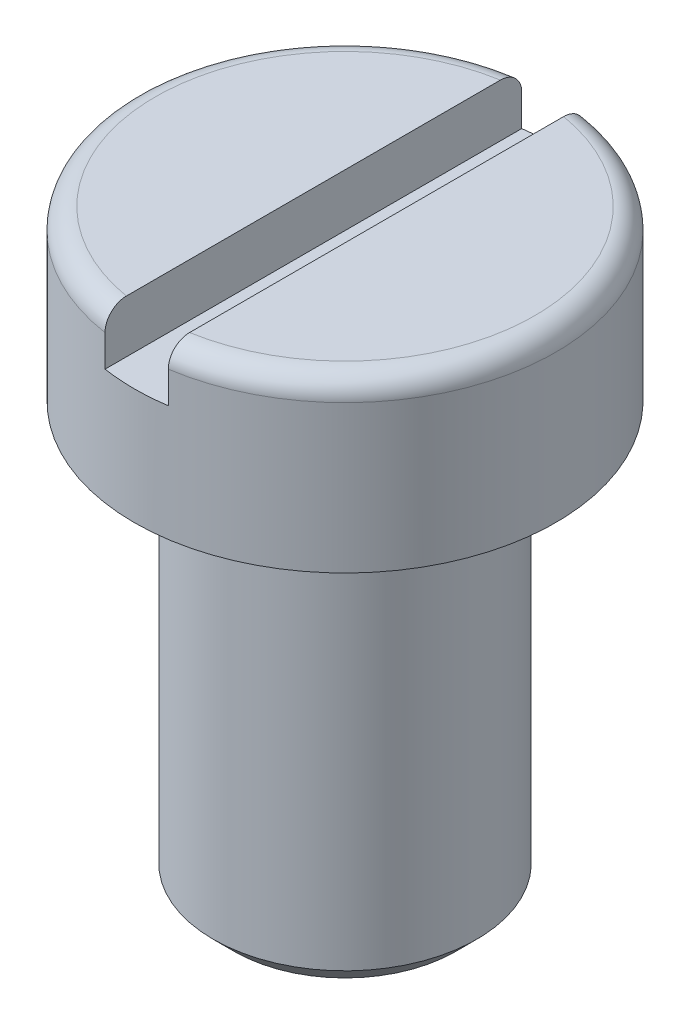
ISO-10303-21;
HEADER;
FILE_DESCRIPTION(('STEP AP214'),'2;1');
FILE_NAME('part.step','',(''),(''),'','','');
FILE_SCHEMA(('AUTOMOTIVE_DESIGN { 1 0 10303 214 1 1 1 1 }'));
ENDSEC;
DATA;
#1=APPLICATION_CONTEXT('core data for automotive mechanical design processes');
#2=APPLICATION_PROTOCOL_DEFINITION('international standard','automotive_design',2000,#1);
#3=PRODUCT_CONTEXT('',#1,'mechanical');
#4=PRODUCT('Part','Part','',(#3));
#5=PRODUCT_RELATED_PRODUCT_CATEGORY('part','',(#4));
#6=PRODUCT_DEFINITION_FORMATION('','',#4);
#7=PRODUCT_DEFINITION_CONTEXT('part definition',#1,'design');
#8=PRODUCT_DEFINITION('design','',#6,#7);
#9=PRODUCT_DEFINITION_SHAPE('','',#8);
#10=(LENGTH_UNIT() NAMED_UNIT(*) SI_UNIT(.MILLI.,.METRE.));
#11=(NAMED_UNIT(*) PLANE_ANGLE_UNIT() SI_UNIT($,.RADIAN.));
#12=(NAMED_UNIT(*) SI_UNIT($,.STERADIAN.) SOLID_ANGLE_UNIT());
#13=UNCERTAINTY_MEASURE_WITH_UNIT(LENGTH_MEASURE(1.E-05),#10,'distance_accuracy_value','');
#14=(GEOMETRIC_REPRESENTATION_CONTEXT(3) GLOBAL_UNCERTAINTY_ASSIGNED_CONTEXT((#13)) GLOBAL_UNIT_ASSIGNED_CONTEXT((#10,
#11,#12)) REPRESENTATION_CONTEXT('',''));
#15=CARTESIAN_POINT('',(0.,0.,0.));
#16=DIRECTION('',(0.,0.,1.));
#17=DIRECTION('',(1.,0.,0.));
#18=AXIS2_PLACEMENT_3D('',#15,#16,#17);
#19=CARTESIAN_POINT('',(2.,5.6,0.));
#20=DIRECTION('',(0.,-1.,0.));
#21=DIRECTION('',(0.,0.,-1.));
#22=AXIS2_PLACEMENT_3D('',#19,#20,#21);
#23=PLANE('',#22);
#24=CARTESIAN_POINT('',(0.,5.6,0.));
#25=DIRECTION('',(0.,-1.,0.));
#26=DIRECTION('',(0.,0.,-1.));
#27=AXIS2_PLACEMENT_3D('',#24,#25,#26);
#28=CIRCLE('',#27,1.8);
#29=CARTESIAN_POINT('',(0.3,5.60000000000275,1.77482393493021));
#30=VERTEX_POINT('',#29);
#31=CARTESIAN_POINT('',(0.3,5.6,-1.77482393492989));
#32=VERTEX_POINT('',#31);
#33=EDGE_CURVE('E129',#30,#32,#28,.F.);
#34=ORIENTED_EDGE('',*,*,#33,.T.);
#35=DIRECTION('',(0.,0.,1.));
#36=VECTOR('',#35,1.);
#37=CARTESIAN_POINT('',(0.3,5.6,0.));
#38=LINE('',#37,#36);
#39=EDGE_CURVE('E111',#32,#30,#38,.T.);
#40=ORIENTED_EDGE('',*,*,#39,.T.);
#41=EDGE_LOOP('',(#34,#40));
#42=FACE_BOUND('',#41,.T.);
#43=ADVANCED_FACE('F34',(#42),#23,.F.);
#44=CARTESIAN_POINT('',(0.,5.4,0.));
#45=DIRECTION('',(0.,-1.,0.));
#46=DIRECTION('',(0.,0.,-1.));
#47=AXIS2_PLACEMENT_3D('',#44,#45,#46);
#48=TOROIDAL_SURFACE('',#47,1.8,0.2);
#49=CARTESIAN_POINT('',(0.3,5.50581795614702,-1.94673315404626));
#50=CARTESIAN_POINT('',(0.3,5.49639199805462,-1.95267914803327));
#51=CARTESIAN_POINT('',(0.3,5.48646024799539,-1.95783763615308));
#52=CARTESIAN_POINT('',(0.3,5.46586441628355,-1.96641984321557));
#53=CARTESIAN_POINT('',(0.3,5.45519954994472,-1.96984166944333));
#54=CARTESIAN_POINT('',(0.3,5.43344743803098,-1.97484167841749));
#55=CARTESIAN_POINT('',(0.3,5.42236029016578,-1.97642028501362));
#56=CARTESIAN_POINT('',(0.3,5.40008126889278,-1.9776864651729));
#57=CARTESIAN_POINT('',(0.3,5.3888894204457,-1.97737447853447));
#58=CARTESIAN_POINT('',(0.3,5.36675222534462,-1.97487407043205));
#59=CARTESIAN_POINT('',(0.3,5.35580622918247,-1.97269139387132));
#60=CARTESIAN_POINT('',(0.3,5.33443467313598,-1.96652272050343));
#61=CARTESIAN_POINT('',(0.3,5.32400913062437,-1.96253666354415));
#62=CARTESIAN_POINT('',(0.3,5.30395059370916,-1.95287023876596));
#63=CARTESIAN_POINT('',(0.3,5.29431920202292,-1.94718654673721));
#64=CARTESIAN_POINT('',(0.3,5.2761374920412,-1.93429502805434));
#65=CARTESIAN_POINT('',(0.3,5.26758720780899,-1.92708715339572));
#66=CARTESIAN_POINT('',(0.3,5.25173476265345,-1.91129203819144));
#67=CARTESIAN_POINT('',(0.3,5.24444319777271,-1.90269416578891));
#68=CARTESIAN_POINT('',(0.3,5.23138729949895,-1.88440831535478));
#69=CARTESIAN_POINT('',(0.3,5.22562305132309,-1.87472027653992));
#70=CARTESIAN_POINT('',(0.3,5.21571351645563,-1.85440861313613));
#71=CARTESIAN_POINT('',(0.3,5.21158789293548,-1.84377539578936));
#72=CARTESIAN_POINT('',(0.3,5.20515788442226,-1.82197190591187));
#73=CARTESIAN_POINT('',(0.3,5.20285361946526,-1.81080159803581));
#74=CARTESIAN_POINT('',(0.3,5.20010731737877,-1.78810582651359));
#75=CARTESIAN_POINT('',(0.3,5.19968665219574,-1.77657777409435));
#76=CARTESIAN_POINT('',(0.3,5.20077363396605,-1.75361271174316));
#77=CARTESIAN_POINT('',(0.3,5.20228137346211,-1.74217570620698));
#78=CARTESIAN_POINT('',(0.3,5.20719894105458,-1.71964314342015));
#79=CARTESIAN_POINT('',(0.3,5.21062053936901,-1.70855015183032));
#80=CARTESIAN_POINT('',(0.3,5.21928237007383,-1.68709797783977));
#81=CARTESIAN_POINT('',(0.3,5.22452260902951,-1.67673879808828));
#82=CARTESIAN_POINT('',(0.3,5.23666393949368,-1.6570836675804));
#83=CARTESIAN_POINT('',(0.3,5.24356035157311,-1.647784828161));
#84=CARTESIAN_POINT('',(0.3,5.25883417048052,-1.63049484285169));
#85=CARTESIAN_POINT('',(0.3,5.26721148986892,-1.62250361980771));
#86=CARTESIAN_POINT('',(0.3,5.28510253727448,-1.60816402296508));
#87=CARTESIAN_POINT('',(0.3,5.29460111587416,-1.60179675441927));
#88=CARTESIAN_POINT('',(0.3,5.31454664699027,-1.5907787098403));
#89=CARTESIAN_POINT('',(0.3,5.32499350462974,-1.58612776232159));
#90=CARTESIAN_POINT('',(0.3,5.34635323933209,-1.57875433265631));
#91=CARTESIAN_POINT('',(0.3,5.35725554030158,-1.57600120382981));
#92=CARTESIAN_POINT('',(0.3,5.37936932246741,-1.57238902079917));
#93=CARTESIAN_POINT('',(0.3,5.3905807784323,-1.57152981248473));
#94=CARTESIAN_POINT('',(0.3,5.41285260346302,-1.57173189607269));
#95=CARTESIAN_POINT('',(0.3,5.42391318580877,-1.57277050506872));
#96=CARTESIAN_POINT('',(0.3,5.4457023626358,-1.57669071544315));
#97=CARTESIAN_POINT('',(0.3,5.45643096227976,-1.57957228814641));
#98=CARTESIAN_POINT('',(0.3,5.47725322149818,-1.58708729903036));
#99=CARTESIAN_POINT('',(0.3,5.48734698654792,-1.59172044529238));
#100=CARTESIAN_POINT('',(0.3,5.50662554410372,-1.60259704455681));
#101=CARTESIAN_POINT('',(0.3,5.51581029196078,-1.60884057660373));
#102=CARTESIAN_POINT('',(0.3,5.53312543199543,-1.62283357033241));
#103=CARTESIAN_POINT('',(0.3,5.54124253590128,-1.63059946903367));
#104=CARTESIAN_POINT('',(0.3,5.55608358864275,-1.64736430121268));
#105=CARTESIAN_POINT('',(0.3,5.56280741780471,-1.65636334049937));
#106=CARTESIAN_POINT('',(0.3,5.57478654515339,-1.67549696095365));
#107=CARTESIAN_POINT('',(0.3,5.58001603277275,-1.68564770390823));
#108=CARTESIAN_POINT('',(0.3,5.58872147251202,-1.70667523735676));
#109=CARTESIAN_POINT('',(0.3,5.59219728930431,-1.71755208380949));
#110=CARTESIAN_POINT('',(0.3,5.59733740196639,-1.73987258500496));
#111=CARTESIAN_POINT('',(0.3,5.59897798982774,-1.75132170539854));
#112=CARTESIAN_POINT('',(0.3,5.60032192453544,-1.77433293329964));
#113=CARTESIAN_POINT('',(0.3,5.60002527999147,-1.78589504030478));
#114=CARTESIAN_POINT('',(0.3,5.59749470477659,-1.80884900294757));
#115=CARTESIAN_POINT('',(0.3,5.59525361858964,-1.82024007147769));
#116=CARTESIAN_POINT('',(0.3,5.58887960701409,-1.84248372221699));
#117=CARTESIAN_POINT('',(0.3,5.58474624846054,-1.85333618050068));
#118=CARTESIAN_POINT('',(0.3,5.574723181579,-1.8741296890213));
#119=CARTESIAN_POINT('',(0.3,5.56884232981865,-1.88407501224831));
#120=CARTESIAN_POINT('',(0.3,5.55548020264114,-1.90281298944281));
#121=CARTESIAN_POINT('',(0.3,5.54800095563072,-1.91160708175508));
#122=CARTESIAN_POINT('',(0.3,5.53467358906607,-1.92479930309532));
#123=CARTESIAN_POINT('',(0.3,5.52923992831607,-1.92962322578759));
#124=CARTESIAN_POINT('',(0.3,5.51788167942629,-1.93865383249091));
#125=CARTESIAN_POINT('',(0.3,5.51195709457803,-1.94286052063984));
#126=CARTESIAN_POINT('',(0.3,5.50581795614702,-1.94673315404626));
#127=B_SPLINE_CURVE_WITH_KNOTS('',3,(#49,#50,#51,#52,#53,#54,#55,#56,#57,#58,#59,#60,#61,#62,
#63,#64,#65,#66,#67,#68,#69,#70,#71,#72,#73,#74,#75,#76,#77,#78,#79,#80,#81,#82,#83,#84,#85,#86,
#87,#88,#89,#90,#91,#92,#93,#94,#95,#96,#97,#98,#99,#100,#101,#102,#103,#104,#105,#106,#107,
#108,#109,#110,#111,#112,#113,#114,#115,#116,#117,#118,#119,#120,#121,#122,#123,#124,#125,#126),
.UNSPECIFIED.,.T.,.F.,(4,2,2,2,2,2,2,2,2,2,2,2,2,2,2,2,2,2,2,2,2,2,2,2,2,2,2,2,2,2,2,2,2,2,2,2,
2,2,4),(0.,0.033407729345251,0.0668517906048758,0.100288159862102,0.133716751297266,
0.16704304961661,0.200370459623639,0.233763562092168,0.267157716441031,0.300820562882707,
0.334485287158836,0.368542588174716,0.402602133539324,0.437047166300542,0.471493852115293,
0.506154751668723,0.540815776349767,0.575379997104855,0.609942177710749,0.644081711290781,
0.678217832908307,0.711788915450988,0.745357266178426,0.778527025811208,0.811696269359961,
0.844859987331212,0.87802533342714,0.911570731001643,0.945119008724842,0.979215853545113,
1.01331532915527,1.04785039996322,1.08238531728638,1.11704786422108,1.15171834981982,
1.18621603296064,1.22067019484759,1.2424288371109,1.26418733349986),.UNSPECIFIED.);
#128=CARTESIAN_POINT('',(0.3,5.39999999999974,-1.97737199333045));
#129=VERTEX_POINT('',#128);
#130=EDGE_CURVE('E57',#32,#129,#127,.T.);
#131=ORIENTED_EDGE('',*,*,#130,.F.);
#132=ORIENTED_EDGE('',*,*,#33,.F.);
#133=CARTESIAN_POINT('',(0.3,5.48593501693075,1.59137267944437));
#134=CARTESIAN_POINT('',(0.3,5.47596944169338,1.5865476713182));
#135=CARTESIAN_POINT('',(0.3,5.46559278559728,1.58255469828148));
#136=CARTESIAN_POINT('',(0.3,5.44430883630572,1.57636279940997));
#137=CARTESIAN_POINT('',(0.3,5.43340100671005,1.57416572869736));
#138=CARTESIAN_POINT('',(0.3,5.41137201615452,1.57164002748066));
#139=CARTESIAN_POINT('',(0.3,5.40025089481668,1.57131105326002));
#140=CARTESIAN_POINT('',(0.3,5.37811500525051,1.57253171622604));
#141=CARTESIAN_POINT('',(0.3,5.36710021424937,1.57408094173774));
#142=CARTESIAN_POINT('',(0.3,5.34551931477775,1.57900052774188));
#143=CARTESIAN_POINT('',(0.3,5.33495199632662,1.58236558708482));
#144=CARTESIAN_POINT('',(0.3,5.31452562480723,1.59080886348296));
#145=CARTESIAN_POINT('',(0.3,5.30466661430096,1.59588718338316));
#146=CARTESIAN_POINT('',(0.3,5.28585195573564,1.60764896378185));
#147=CARTESIAN_POINT('',(0.3,5.27690387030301,1.61434451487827));
#148=CARTESIAN_POINT('',(0.3,5.26023687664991,1.62912153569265));
#149=CARTESIAN_POINT('',(0.3,5.25251806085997,1.63720310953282));
#150=CARTESIAN_POINT('',(0.3,5.23840008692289,1.65465695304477));
#151=CARTESIAN_POINT('',(0.3,5.23202337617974,1.66404737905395));
#152=CARTESIAN_POINT('',(0.3,5.22090963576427,1.68375292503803));
#153=CARTESIAN_POINT('',(0.3,5.21617274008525,1.69406812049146));
#154=CARTESIAN_POINT('',(0.3,5.20840282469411,1.71549636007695));
#155=CARTESIAN_POINT('',(0.3,5.20539629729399,1.7266190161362));
#156=CARTESIAN_POINT('',(0.3,5.20127780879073,1.74920994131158));
#157=CARTESIAN_POINT('',(0.3,5.2001659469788,1.7606782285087));
#158=CARTESIAN_POINT('',(0.3,5.19986747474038,1.78372481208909));
#159=CARTESIAN_POINT('',(0.3,5.20069509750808,1.79530329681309));
#160=CARTESIAN_POINT('',(0.3,5.20428688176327,1.81815624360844));
#161=CARTESIAN_POINT('',(0.3,5.207051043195,1.82943070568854));
#162=CARTESIAN_POINT('',(0.3,5.2144365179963,1.85132497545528));
#163=CARTESIAN_POINT('',(0.3,5.21905345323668,1.8619462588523));
#164=CARTESIAN_POINT('',(0.3,5.23002177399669,1.88225233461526));
#165=CARTESIAN_POINT('',(0.3,5.23637308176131,1.89193716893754));
#166=CARTESIAN_POINT('',(0.3,5.2505664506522,1.90999388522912));
#167=CARTESIAN_POINT('',(0.3,5.25839355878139,1.91837751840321));
#168=CARTESIAN_POINT('',(0.3,5.27535960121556,1.9336917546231));
#169=CARTESIAN_POINT('',(0.3,5.28449844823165,1.94062245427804));
#170=CARTESIAN_POINT('',(0.3,5.30370882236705,1.95274489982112));
#171=CARTESIAN_POINT('',(0.3,5.31376763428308,1.95795679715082));
#172=CARTESIAN_POINT('',(0.3,5.33462378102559,1.96659820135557));
#173=CARTESIAN_POINT('',(0.3,5.34542107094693,1.97002781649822));
#174=CARTESIAN_POINT('',(0.3,5.36733115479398,1.97497453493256));
#175=CARTESIAN_POINT('',(0.3,5.37843970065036,1.97651046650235));
#176=CARTESIAN_POINT('',(0.3,5.40075652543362,1.97768596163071));
#177=CARTESIAN_POINT('',(0.3,5.41196480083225,1.97732559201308));
#178=CARTESIAN_POINT('',(0.3,5.43410829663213,1.97472563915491));
#179=CARTESIAN_POINT('',(0.3,5.44504454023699,1.97249475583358));
#180=CARTESIAN_POINT('',(0.3,5.46638838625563,1.96623223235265));
#181=CARTESIAN_POINT('',(0.3,5.47679598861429,1.96220059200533));
#182=CARTESIAN_POINT('',(0.3,5.49681238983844,1.95244628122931));
#183=CARTESIAN_POINT('',(0.3,5.50641948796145,1.94672012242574));
#184=CARTESIAN_POINT('',(0.3,5.52454597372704,1.93374840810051));
#185=CARTESIAN_POINT('',(0.3,5.53306532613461,1.92650280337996));
#186=CARTESIAN_POINT('',(0.3,5.54885044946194,1.91063718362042));
#187=CARTESIAN_POINT('',(0.3,5.55610549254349,1.90200649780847));
#188=CARTESIAN_POINT('',(0.3,5.56908348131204,1.88366152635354));
#189=CARTESIAN_POINT('',(0.3,5.57480633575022,1.87394717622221));
#190=CARTESIAN_POINT('',(0.3,5.5846289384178,1.85358959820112));
#191=CARTESIAN_POINT('',(0.3,5.58870894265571,1.8429368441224));
#192=CARTESIAN_POINT('',(0.3,5.59504504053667,1.8211020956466));
#193=CARTESIAN_POINT('',(0.3,5.59730101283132,1.80992006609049));
#194=CARTESIAN_POINT('',(0.3,5.59994873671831,1.78720909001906));
#195=CARTESIAN_POINT('',(0.3,5.60031913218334,1.77567765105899));
#196=CARTESIAN_POINT('',(0.3,5.59913152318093,1.75271469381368));
#197=CARTESIAN_POINT('',(0.3,5.59757349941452,1.74128317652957));
#198=CARTESIAN_POINT('',(0.3,5.59255698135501,1.71877235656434));
#199=CARTESIAN_POINT('',(0.3,5.58908710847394,1.70769558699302));
#200=CARTESIAN_POINT('',(0.3,5.58033076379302,1.68628096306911));
#201=CARTESIAN_POINT('',(0.3,5.57504383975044,1.67594329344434));
#202=CARTESIAN_POINT('',(0.3,5.56281194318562,1.65633625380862));
#203=CARTESIAN_POINT('',(0.3,5.555871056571,1.64706433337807));
#204=CARTESIAN_POINT('',(0.3,5.54051799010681,1.62984458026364));
#205=CARTESIAN_POINT('',(0.3,5.53210768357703,1.62189508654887));
#206=CARTESIAN_POINT('',(0.3,5.51734496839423,1.61016989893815));
#207=CARTESIAN_POINT('',(0.3,5.51135679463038,1.6059278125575));
#208=CARTESIAN_POINT('',(0.3,5.49895081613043,1.59812647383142));
#209=CARTESIAN_POINT('',(0.3,5.49253301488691,1.59456721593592));
#210=CARTESIAN_POINT('',(0.3,5.48593501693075,1.59137267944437));
#211=B_SPLINE_CURVE_WITH_KNOTS('',3,(#133,#134,#135,#136,#137,#138,#139,#140,#141,#142,#143,
#144,#145,#146,#147,#148,#149,#150,#151,#152,#153,#154,#155,#156,#157,#158,#159,#160,#161,#162,
#163,#164,#165,#166,#167,#168,#169,#170,#171,#172,#173,#174,#175,#176,#177,#178,#179,#180,#181,
#182,#183,#184,#185,#186,#187,#188,#189,#190,#191,#192,#193,#194,#195,#196,#197,#198,#199,#200,
#201,#202,#203,#204,#205,#206,#207,#208,#209,#210),.UNSPECIFIED.,.T.,.F.,(4,2,2,2,2,2,2,2,2,2,2,
2,2,2,2,2,2,2,2,2,2,2,2,2,2,2,2,2,2,2,2,2,2,2,2,2,2,2,4),(0.,0.0331901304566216,
0.0664145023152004,0.0996327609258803,0.132843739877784,0.165958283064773,0.199074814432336,
0.232447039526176,0.265821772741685,0.299716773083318,0.333614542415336,0.368018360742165,
0.402423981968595,0.437082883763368,0.471741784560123,0.506319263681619,0.540895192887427,
0.575137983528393,0.609378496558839,0.64320197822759,0.677023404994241,0.710505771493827,
0.743986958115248,0.77731327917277,0.810639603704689,0.844035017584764,0.877431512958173,
0.911098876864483,0.944768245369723,0.978830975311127,1.01289597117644,1.04734594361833,
1.08179626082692,1.11645386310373,1.15112009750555,1.18570156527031,1.22023926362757,
1.24221393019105,1.26418841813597),.UNSPECIFIED.);
#212=CARTESIAN_POINT('',(0.3,5.40000000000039,1.97737199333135));
#213=VERTEX_POINT('',#212);
#214=EDGE_CURVE('E183',#213,#30,#211,.T.);
#215=ORIENTED_EDGE('',*,*,#214,.F.);
#216=CARTESIAN_POINT('',(0.,5.4,0.));
#217=DIRECTION('',(0.,-1.,0.));
#218=DIRECTION('',(0.,0.,-1.));
#219=AXIS2_PLACEMENT_3D('',#216,#217,#218);
#220=CIRCLE('',#219,2.);
#221=EDGE_CURVE('E133',#129,#213,#220,.T.);
#222=ORIENTED_EDGE('',*,*,#221,.F.);
#223=EDGE_LOOP('',(#131,#132,#215,#222));
#224=FACE_BOUND('',#223,.T.);
#225=ADVANCED_FACE('F169',(#224),#48,.T.);
#226=CARTESIAN_POINT('',(0.,0.,0.));
#227=DIRECTION('',(0.,1.,0.));
#228=DIRECTION('',(0.,0.,1.));
#229=AXIS2_PLACEMENT_3D('',#226,#227,#228);
#230=PLANE('',#229);
#231=CARTESIAN_POINT('',(0.,0.,0.));
#232=DIRECTION('',(0.,1.,0.));
#233=DIRECTION('',(0.,0.,1.));
#234=AXIS2_PLACEMENT_3D('',#231,#232,#233);
#235=CIRCLE('',#234,1.05);
#236=CARTESIAN_POINT('',(0.,0.,1.05));
#237=VERTEX_POINT('',#236);
#238=EDGE_CURVE('E11',#237,#237,#235,.F.);
#239=ORIENTED_EDGE('',*,*,#238,.T.);
#240=EDGE_LOOP('',(#239));
#241=FACE_BOUND('',#240,.T.);
#242=ADVANCED_FACE('F166',(#241),#230,.F.);
#243=CARTESIAN_POINT('',(0.,38.5811565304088,0.));
#244=DIRECTION('',(0.,1.,0.));
#245=DIRECTION('',(0.,0.,1.));
#246=AXIS2_PLACEMENT_3D('',#243,#244,#245);
#247=CYLINDRICAL_SURFACE('',#246,1.25);
#248=CARTESIAN_POINT('',(0.,0.199999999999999,0.));
#249=DIRECTION('',(0.,1.,0.));
#250=DIRECTION('',(0.,0.,1.));
#251=AXIS2_PLACEMENT_3D('',#248,#249,#250);
#252=CIRCLE('',#251,1.25);
#253=CARTESIAN_POINT('',(0.,0.199999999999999,1.25));
#254=VERTEX_POINT('',#253);
#255=EDGE_CURVE('E42',#254,#254,#252,.T.);
#256=ORIENTED_EDGE('',*,*,#255,.T.);
#257=EDGE_LOOP('',(#256));
#258=FACE_BOUND('',#257,.T.);
#259=CARTESIAN_POINT('',(0.,4.,0.));
#260=DIRECTION('',(0.,1.,0.));
#261=DIRECTION('',(0.,0.,1.));
#262=AXIS2_PLACEMENT_3D('',#259,#260,#261);
#263=CIRCLE('',#262,1.25);
#264=CARTESIAN_POINT('',(0.,4.,1.25));
#265=VERTEX_POINT('',#264);
#266=EDGE_CURVE('E126',#265,#265,#263,.T.);
#267=ORIENTED_EDGE('',*,*,#266,.F.);
#268=EDGE_LOOP('',(#267));
#269=FACE_BOUND('',#268,.T.);
#270=ADVANCED_FACE('F163',(#258,#269),#247,.T.);
#271=CARTESIAN_POINT('',(1.25,4.,0.));
#272=DIRECTION('',(0.,1.,0.));
#273=DIRECTION('',(0.,0.,1.));
#274=AXIS2_PLACEMENT_3D('',#271,#272,#273);
#275=PLANE('',#274);
#276=CARTESIAN_POINT('',(0.,4.,0.));
#277=DIRECTION('',(0.,1.,0.));
#278=DIRECTION('',(0.,0.,1.));
#279=AXIS2_PLACEMENT_3D('',#276,#277,#278);
#280=CIRCLE('',#279,2.);
#281=CARTESIAN_POINT('',(0.,4.,2.));
#282=VERTEX_POINT('',#281);
#283=EDGE_CURVE('E123',#282,#282,#280,.T.);
#284=ORIENTED_EDGE('',*,*,#283,.F.);
#285=EDGE_LOOP('',(#284));
#286=FACE_BOUND('',#285,.T.);
#287=ORIENTED_EDGE('',*,*,#266,.T.);
#288=EDGE_LOOP('',(#287));
#289=FACE_BOUND('',#288,.T.);
#290=ADVANCED_FACE('F160',(#286,#289),#275,.F.);
#291=CARTESIAN_POINT('',(0.,38.5811565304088,0.));
#292=DIRECTION('',(0.,1.,0.));
#293=DIRECTION('',(0.,0.,1.));
#294=AXIS2_PLACEMENT_3D('',#291,#292,#293);
#295=CYLINDRICAL_SURFACE('',#294,2.);
#296=ORIENTED_EDGE('',*,*,#221,.T.);
#297=DIRECTION('',(0.,1.,0.));
#298=VECTOR('',#297,1.);
#299=CARTESIAN_POINT('',(0.300000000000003,38.5811565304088,1.97737199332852));
#300=LINE('',#299,#298);
#301=CARTESIAN_POINT('',(0.3,5.1,1.97737199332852));
#302=VERTEX_POINT('',#301);
#303=EDGE_CURVE('E114',#213,#302,#300,.F.);
#304=ORIENTED_EDGE('',*,*,#303,.T.);
#305=CARTESIAN_POINT('',(0.,5.1,0.));
#306=DIRECTION('',(0.,-1.,0.));
#307=DIRECTION('',(1.,0.,0.));
#308=AXIS2_PLACEMENT_3D('',#305,#306,#307);
#309=CIRCLE('',#308,2.);
#310=CARTESIAN_POINT('',(-0.3,5.1,1.97737199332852));
#311=VERTEX_POINT('',#310);
#312=EDGE_CURVE('E97',#302,#311,#309,.T.);
#313=ORIENTED_EDGE('',*,*,#312,.T.);
#314=DIRECTION('',(0.,1.,0.));
#315=VECTOR('',#314,1.);
#316=CARTESIAN_POINT('',(-0.300000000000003,38.5811565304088,1.97737199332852));
#317=LINE('',#316,#315);
#318=CARTESIAN_POINT('',(-0.3,5.4,1.97737199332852));
#319=VERTEX_POINT('',#318);
#320=EDGE_CURVE('E103',#311,#319,#317,.T.);
#321=ORIENTED_EDGE('',*,*,#320,.T.);
#322=CARTESIAN_POINT('',(-0.3,5.4,-1.97737199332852));
#323=VERTEX_POINT('',#322);
#324=EDGE_CURVE('E110',#319,#323,#220,.T.);
#325=ORIENTED_EDGE('',*,*,#324,.T.);
#326=DIRECTION('',(0.,1.,0.));
#327=VECTOR('',#326,1.);
#328=CARTESIAN_POINT('',(-0.300000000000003,38.5811565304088,-1.97737199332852));
#329=LINE('',#328,#327);
#330=CARTESIAN_POINT('',(-0.3,5.1,-1.97737199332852));
#331=VERTEX_POINT('',#330);
#332=EDGE_CURVE('E100',#323,#331,#329,.F.);
#333=ORIENTED_EDGE('',*,*,#332,.T.);
#334=CARTESIAN_POINT('',(0.3,5.1,-1.97737199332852));
#335=VERTEX_POINT('',#334);
#336=EDGE_CURVE('E88',#331,#335,#309,.T.);
#337=ORIENTED_EDGE('',*,*,#336,.T.);
#338=DIRECTION('',(0.,1.,0.));
#339=VECTOR('',#338,1.);
#340=CARTESIAN_POINT('',(0.300000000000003,38.5811565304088,-1.97737199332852));
#341=LINE('',#340,#339);
#342=EDGE_CURVE('E121',#335,#129,#341,.T.);
#343=ORIENTED_EDGE('',*,*,#342,.T.);
#344=EDGE_LOOP('',(#296,#304,#313,#321,#325,#333,#337,#343));
#345=FACE_BOUND('',#344,.T.);
#346=ORIENTED_EDGE('',*,*,#283,.T.);
#347=EDGE_LOOP('',(#346));
#348=FACE_BOUND('',#347,.T.);
#349=ADVANCED_FACE('F107',(#345,#348),#295,.T.);
#350=CARTESIAN_POINT('',(-0.3,5.6,-1.77482393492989));
#351=VERTEX_POINT('',#350);
#352=CARTESIAN_POINT('',(-0.3,5.6,1.77482393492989));
#353=VERTEX_POINT('',#352);
#354=EDGE_CURVE('E130',#351,#353,#28,.F.);
#355=ORIENTED_EDGE('',*,*,#354,.T.);
#356=DIRECTION('',(0.,0.,-1.));
#357=VECTOR('',#356,1.);
#358=CARTESIAN_POINT('',(-0.3,5.6,0.));
#359=LINE('',#358,#357);
#360=EDGE_CURVE('E49',#353,#351,#359,.T.);
#361=ORIENTED_EDGE('',*,*,#360,.T.);
#362=EDGE_LOOP('',(#355,#361));
#363=FACE_BOUND('',#362,.T.);
#364=ADVANCED_FACE('F153',(#363),#23,.F.);
#365=CARTESIAN_POINT('',(-0.3,5.50581795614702,-1.94673315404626));
#366=CARTESIAN_POINT('',(-0.3,5.51538015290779,-1.94070000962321));
#367=CARTESIAN_POINT('',(-0.3,5.5244357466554,-1.93384739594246));
#368=CARTESIAN_POINT('',(-0.3,5.54127087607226,-1.91870861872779));
#369=CARTESIAN_POINT('',(-0.3,5.54904869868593,-1.9104205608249));
#370=CARTESIAN_POINT('',(-0.3,5.56309962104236,-1.89266720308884));
#371=CARTESIAN_POINT('',(-0.3,5.56937420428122,-1.88320307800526));
#372=CARTESIAN_POINT('',(-0.3,5.58025982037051,-1.86336628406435));
#373=CARTESIAN_POINT('',(-0.3,5.58487125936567,-1.85299383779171));
#374=CARTESIAN_POINT('',(-0.3,5.59234888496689,-1.83153289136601));
#375=CARTESIAN_POINT('',(-0.3,5.59519896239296,-1.82043877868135));
#376=CARTESIAN_POINT('',(-0.3,5.5990168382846,-1.79793073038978));
#377=CARTESIAN_POINT('',(-0.3,5.5999844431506,-1.78651676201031));
#378=CARTESIAN_POINT('',(-0.3,5.60001533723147,-1.76357119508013));
#379=CARTESIAN_POINT('',(-0.3,5.5990593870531,-1.75203956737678));
#380=CARTESIAN_POINT('',(-0.3,5.59523217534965,-1.72929832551));
#381=CARTESIAN_POINT('',(-0.3,5.59236084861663,-1.71808872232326));
#382=CARTESIAN_POINT('',(-0.3,5.58476707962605,-1.69627246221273));
#383=CARTESIAN_POINT('',(-0.3,5.58003848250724,-1.6856679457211));
#384=CARTESIAN_POINT('',(-0.3,5.56885722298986,-1.66540995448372));
#385=CARTESIAN_POINT('',(-0.3,5.56240459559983,-1.65575646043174));
#386=CARTESIAN_POINT('',(-0.3,5.5479967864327,-1.63774507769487));
#387=CARTESIAN_POINT('',(-0.3,5.54005143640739,-1.62937932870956));
#388=CARTESIAN_POINT('',(-0.3,5.52285053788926,-1.61412460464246));
#389=CARTESIAN_POINT('',(-0.3,5.51359509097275,-1.60723551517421));
#390=CARTESIAN_POINT('',(-0.3,5.49418056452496,-1.59523970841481));
#391=CARTESIAN_POINT('',(-0.3,5.48403670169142,-1.59010836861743));
#392=CARTESIAN_POINT('',(-0.3,5.46302169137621,-1.58165332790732));
#393=CARTESIAN_POINT('',(-0.3,5.45215061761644,-1.5783294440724));
#394=CARTESIAN_POINT('',(-0.3,5.43017641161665,-1.57363529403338));
#395=CARTESIAN_POINT('',(-0.3,5.41907975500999,-1.57223468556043));
#396=CARTESIAN_POINT('',(-0.3,5.39680984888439,-1.5713334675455));
#397=CARTESIAN_POINT('',(-0.3,5.3856366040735,-1.57183274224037));
#398=CARTESIAN_POINT('',(-0.3,5.36362714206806,-1.57470300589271));
#399=CARTESIAN_POINT('',(-0.3,5.35278891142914,-1.57705859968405));
#400=CARTESIAN_POINT('',(-0.3,5.33165911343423,-1.58354823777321));
#401=CARTESIAN_POINT('',(-0.3,5.3213675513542,-1.5876822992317));
#402=CARTESIAN_POINT('',(-0.3,5.30157096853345,-1.59762371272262));
#403=CARTESIAN_POINT('',(-0.3,5.29206960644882,-1.60343834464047));
#404=CARTESIAN_POINT('',(-0.3,5.27416003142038,-1.61655914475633));
#405=CARTESIAN_POINT('',(-0.3,5.26575189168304,-1.62386541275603));
#406=CARTESIAN_POINT('',(-0.3,5.25013852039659,-1.63987116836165));
#407=CARTESIAN_POINT('',(-0.3,5.24295204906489,-1.64858895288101));
#408=CARTESIAN_POINT('',(-0.3,5.23011710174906,-1.66709127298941));
#409=CARTESIAN_POINT('',(-0.3,5.22446875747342,-1.67687589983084));
#410=CARTESIAN_POINT('',(-0.3,5.21477797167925,-1.6974023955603));
#411=CARTESIAN_POINT('',(-0.3,5.21076260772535,-1.70815705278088));
#412=CARTESIAN_POINT('',(-0.3,5.20457418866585,-1.73018411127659));
#413=CARTESIAN_POINT('',(-0.3,5.20240125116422,-1.74145654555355));
#414=CARTESIAN_POINT('',(-0.3,5.19994392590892,-1.76431912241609));
#415=CARTESIAN_POINT('',(-0.3,5.19967849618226,-1.77591130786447));
#416=CARTESIAN_POINT('',(-0.3,5.20109658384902,-1.79897615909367));
#417=CARTESIAN_POINT('',(-0.3,5.20278012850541,-1.8104488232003));
#418=CARTESIAN_POINT('',(-0.3,5.20805579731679,-1.83295062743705));
#419=CARTESIAN_POINT('',(-0.3,5.21164847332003,-1.84397963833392));
#420=CARTESIAN_POINT('',(-0.3,5.22064918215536,-1.86527062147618));
#421=CARTESIAN_POINT('',(-0.3,5.22605715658,-1.87553261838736));
#422=CARTESIAN_POINT('',(-0.3,5.23849169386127,-1.89490799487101));
#423=CARTESIAN_POINT('',(-0.3,5.24550492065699,-1.9040299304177));
#424=CARTESIAN_POINT('',(-0.3,5.26098031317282,-1.92094883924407));
#425=CARTESIAN_POINT('',(-0.3,5.26944238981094,-1.92874589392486));
#426=CARTESIAN_POINT('',(-0.3,5.28746684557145,-1.9426941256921));
#427=CARTESIAN_POINT('',(-0.3,5.29701485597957,-1.94886387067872));
#428=CARTESIAN_POINT('',(-0.3,5.31701981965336,-1.95949163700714));
#429=CARTESIAN_POINT('',(-0.3,5.32747667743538,-1.96394983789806));
#430=CARTESIAN_POINT('',(-0.3,5.34887722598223,-1.97097870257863));
#431=CARTESIAN_POINT('',(-0.3,5.35981419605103,-1.97356983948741));
#432=CARTESIAN_POINT('',(-0.3,5.38197173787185,-1.9768665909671));
#433=CARTESIAN_POINT('',(-0.3,5.39319236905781,-1.9775718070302));
#434=CARTESIAN_POINT('',(-0.3,5.41552411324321,-1.97707611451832));
#435=CARTESIAN_POINT('',(-0.3,5.42663548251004,-1.97588636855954));
#436=CARTESIAN_POINT('',(-0.3,5.44849065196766,-1.9716577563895));
#437=CARTESIAN_POINT('',(-0.3,5.45923489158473,-1.96862118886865));
#438=CARTESIAN_POINT('',(-0.3,5.47595734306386,-1.96233842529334));
#439=CARTESIAN_POINT('',(-0.3,5.48214864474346,-1.95964397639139));
#440=CARTESIAN_POINT('',(-0.3,5.49422607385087,-1.95364132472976));
#441=CARTESIAN_POINT('',(-0.3,5.50011220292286,-1.95033312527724));
#442=CARTESIAN_POINT('',(-0.3,5.50581795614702,-1.94673315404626));
#443=B_SPLINE_CURVE_WITH_KNOTS('',3,(#365,#366,#367,#368,#369,#370,#371,#372,#373,#374,#375,
#376,#377,#378,#379,#380,#381,#382,#383,#384,#385,#386,#387,#388,#389,#390,#391,#392,#393,#394,
#395,#396,#397,#398,#399,#400,#401,#402,#403,#404,#405,#406,#407,#408,#409,#410,#411,#412,#413,
#414,#415,#416,#417,#418,#419,#420,#421,#422,#423,#424,#425,#426,#427,#428,#429,#430,#431,#432,
#433,#434,#435,#436,#437,#438,#439,#440,#441,#442),.UNSPECIFIED.,.T.,.F.,(4,2,2,2,2,2,2,2,2,2,2,
2,2,2,2,2,2,2,2,2,2,2,2,2,2,2,2,2,2,2,2,2,2,2,2,2,2,2,4),(0.,0.0338941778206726,
0.0678334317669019,0.101739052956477,0.135636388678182,0.169839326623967,0.204045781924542,
0.238596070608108,0.273147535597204,0.307814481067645,0.342480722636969,0.376926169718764,
0.411368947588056,0.445307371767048,0.479242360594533,0.512635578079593,0.546026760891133,
0.579143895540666,0.612261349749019,0.645524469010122,0.678789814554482,0.712527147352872,
0.746267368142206,0.780546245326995,0.814827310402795,0.849448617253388,0.884070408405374,
0.918702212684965,0.953332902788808,0.987685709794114,1.02203640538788,1.05597630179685,
1.08991263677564,1.12347093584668,1.15703632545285,1.19040472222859,1.22373167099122,
1.24395640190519,1.26418102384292),.UNSPECIFIED.);
#444=EDGE_CURVE('E140',#323,#351,#443,.T.);
#445=ORIENTED_EDGE('',*,*,#444,.F.);
#446=ORIENTED_EDGE('',*,*,#324,.F.);
#447=CARTESIAN_POINT('',(-0.3,5.48593501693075,1.59137267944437));
#448=CARTESIAN_POINT('',(-0.3,5.49610252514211,1.5962966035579));
#449=CARTESIAN_POINT('',(-0.3,5.50585699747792,1.60209407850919));
#450=CARTESIAN_POINT('',(-0.3,5.52425702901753,1.61525621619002));
#451=CARTESIAN_POINT('',(-0.3,5.53290103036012,1.62262304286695));
#452=CARTESIAN_POINT('',(-0.3,5.54882581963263,1.63868954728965));
#453=CARTESIAN_POINT('',(-0.3,5.55610820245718,1.64738764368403));
#454=CARTESIAN_POINT('',(-0.3,5.56912751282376,1.66586776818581));
#455=CARTESIAN_POINT('',(-0.3,5.574864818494,1.67564953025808));
#456=CARTESIAN_POINT('',(-0.3,5.58470733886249,1.69614584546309));
#457=CARTESIAN_POINT('',(-0.3,5.58879235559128,1.70687009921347));
#458=CARTESIAN_POINT('',(-0.3,5.59512474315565,1.72884874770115));
#459=CARTESIAN_POINT('',(-0.3,5.59737191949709,1.74010319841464));
#460=CARTESIAN_POINT('',(-0.3,5.59998122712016,1.76294433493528));
#461=CARTESIAN_POINT('',(-0.3,5.60032407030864,1.77453322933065));
#462=CARTESIAN_POINT('',(-0.3,5.59906066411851,1.79760458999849));
#463=CARTESIAN_POINT('',(-0.3,5.59745438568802,1.80908705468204));
#464=CARTESIAN_POINT('',(-0.3,5.59233054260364,1.83162370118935));
#465=CARTESIAN_POINT('',(-0.3,5.58881205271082,1.84267767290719));
#466=CARTESIAN_POINT('',(-0.3,5.57995468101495,1.86403085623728));
#467=CARTESIAN_POINT('',(-0.3,5.57461586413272,1.87433009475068));
#468=CARTESIAN_POINT('',(-0.3,5.56231121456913,1.89379232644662));
#469=CARTESIAN_POINT('',(-0.3,5.55535855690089,1.90296364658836));
#470=CARTESIAN_POINT('',(-0.3,5.53999507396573,1.91999095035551));
#471=CARTESIAN_POINT('',(-0.3,5.53158433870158,1.9278470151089));
#472=CARTESIAN_POINT('',(-0.3,5.51365108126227,1.9419205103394));
#473=CARTESIAN_POINT('',(-0.3,5.50414304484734,1.94815639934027));
#474=CARTESIAN_POINT('',(-0.3,5.48420580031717,1.95892242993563));
#475=CARTESIAN_POINT('',(-0.3,5.47377665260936,1.96345268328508));
#476=CARTESIAN_POINT('',(-0.3,5.45241795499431,1.97062835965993));
#477=CARTESIAN_POINT('',(-0.3,5.44149524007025,1.97329413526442));
#478=CARTESIAN_POINT('',(-0.3,5.41935646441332,1.97674075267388));
#479=CARTESIAN_POINT('',(-0.3,5.40814041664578,1.97752167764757));
#480=CARTESIAN_POINT('',(-0.3,5.38581071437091,1.97717605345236));
#481=CARTESIAN_POINT('',(-0.3,5.3746968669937,1.97606181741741));
#482=CARTESIAN_POINT('',(-0.3,5.35281428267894,1.97198312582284));
#483=CARTESIAN_POINT('',(-0.3,5.34204554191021,1.96901869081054));
#484=CARTESIAN_POINT('',(-0.3,5.32115641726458,1.9613282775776));
#485=CARTESIAN_POINT('',(-0.3,5.31103606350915,1.95660221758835));
#486=CARTESIAN_POINT('',(-0.3,5.29172556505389,1.94552859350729));
#487=CARTESIAN_POINT('',(-0.3,5.28253544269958,1.93918099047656));
#488=CARTESIAN_POINT('',(-0.3,5.26528028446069,1.92500329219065));
#489=CARTESIAN_POINT('',(-0.3,5.25722292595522,1.91716385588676));
#490=CARTESIAN_POINT('',(-0.3,5.24252141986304,1.90025651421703));
#491=CARTESIAN_POINT('',(-0.3,5.23587734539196,1.89118854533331));
#492=CARTESIAN_POINT('',(-0.3,5.22411228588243,1.87197593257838));
#493=CARTESIAN_POINT('',(-0.3,5.21900880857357,1.86182056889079));
#494=CARTESIAN_POINT('',(-0.3,5.21055639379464,1.84080431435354));
#495=CARTESIAN_POINT('',(-0.3,5.20720757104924,1.82994337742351));
#496=CARTESIAN_POINT('',(-0.3,5.20231935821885,1.80768607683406));
#497=CARTESIAN_POINT('',(-0.3,5.20080195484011,1.79628488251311));
#498=CARTESIAN_POINT('',(-0.3,5.19968578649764,1.77338882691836));
#499=CARTESIAN_POINT('',(-0.3,5.20008712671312,1.76189396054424));
#500=CARTESIAN_POINT('',(-0.3,5.20280640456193,1.73903762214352));
#501=CARTESIAN_POINT('',(-0.3,5.20513995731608,1.72767800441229));
#502=CARTESIAN_POINT('',(-0.3,5.2116805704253,1.70551110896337));
#503=CARTESIAN_POINT('',(-0.3,5.21588767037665,1.69470384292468));
#504=CARTESIAN_POINT('',(-0.3,5.22606317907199,1.67395176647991));
#505=CARTESIAN_POINT('',(-0.3,5.23203166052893,1.66400699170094));
#506=CARTESIAN_POINT('',(-0.3,5.24556897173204,1.64527324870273));
#507=CARTESIAN_POINT('',(-0.3,5.25313773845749,1.63648423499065));
#508=CARTESIAN_POINT('',(-0.3,5.26958580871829,1.62040794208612));
#509=CARTESIAN_POINT('',(-0.3,5.27845158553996,1.61310682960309));
#510=CARTESIAN_POINT('',(-0.3,5.29729961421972,1.60012605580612));
#511=CARTESIAN_POINT('',(-0.3,5.30728171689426,1.59444617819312));
#512=CARTESIAN_POINT('',(-0.3,5.32790552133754,1.58496705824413));
#513=CARTESIAN_POINT('',(-0.3,5.33853386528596,1.58113874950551));
#514=CARTESIAN_POINT('',(-0.3,5.36029052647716,1.57534896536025));
#515=CARTESIAN_POINT('',(-0.3,5.37141892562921,1.57338779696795));
#516=CARTESIAN_POINT('',(-0.3,5.39369228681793,1.57141085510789));
#517=CARTESIAN_POINT('',(-0.3,5.40483494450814,1.57136886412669));
#518=CARTESIAN_POINT('',(-0.3,5.42695762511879,1.57316616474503));
#519=CARTESIAN_POINT('',(-0.3,5.43793783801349,1.57500304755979));
#520=CARTESIAN_POINT('',(-0.3,5.45509668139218,1.57938502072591));
#521=CARTESIAN_POINT('',(-0.3,5.46142988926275,1.58134790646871));
#522=CARTESIAN_POINT('',(-0.3,5.47386775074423,1.58589795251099));
#523=CARTESIAN_POINT('',(-0.3,5.4799724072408,1.58848510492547));
#524=CARTESIAN_POINT('',(-0.3,5.48593501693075,1.59137267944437));
#525=B_SPLINE_CURVE_WITH_KNOTS('',3,(#447,#448,#449,#450,#451,#452,#453,#454,#455,#456,#457,
#458,#459,#460,#461,#462,#463,#464,#465,#466,#467,#468,#469,#470,#471,#472,#473,#474,#475,#476,
#477,#478,#479,#480,#481,#482,#483,#484,#485,#486,#487,#488,#489,#490,#491,#492,#493,#494,#495,
#496,#497,#498,#499,#500,#501,#502,#503,#504,#505,#506,#507,#508,#509,#510,#511,#512,#513,#514,
#515,#516,#517,#518,#519,#520,#521,#522,#523,#524),.UNSPECIFIED.,.T.,.F.,(4,2,2,2,2,2,2,2,2,2,2,
2,2,2,2,2,2,2,2,2,2,2,2,2,2,2,2,2,2,2,2,2,2,2,2,2,2,2,4),(0.,0.0338664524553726,
0.0677799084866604,0.101653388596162,0.13551857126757,0.169786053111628,0.204057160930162,
0.238674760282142,0.273292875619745,0.307927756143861,0.342561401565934,0.376921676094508,
0.411279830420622,0.445227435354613,0.479172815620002,0.51274160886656,0.546308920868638,
0.579658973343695,0.613008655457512,0.646359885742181,0.679711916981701,0.71328009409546,
0.746850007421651,0.780788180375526,0.814728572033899,0.84907249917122,0.883418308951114,
0.918044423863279,0.952671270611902,0.987299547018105,1.02192645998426,1.05621506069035,
1.09049908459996,1.12422587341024,1.15795820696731,1.19122958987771,1.22445837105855,
1.24431918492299,1.26417974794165),.UNSPECIFIED.);
#526=EDGE_CURVE('E135',#353,#319,#525,.T.);
#527=ORIENTED_EDGE('',*,*,#526,.F.);
#528=ORIENTED_EDGE('',*,*,#354,.F.);
#529=EDGE_LOOP('',(#445,#446,#527,#528));
#530=FACE_BOUND('',#529,.T.);
#531=ADVANCED_FACE('F144',(#530),#48,.T.);
#532=CARTESIAN_POINT('',(-0.3,5.1,-2.5));
#533=DIRECTION('',(0.,-1.,0.));
#534=DIRECTION('',(1.,0.,0.));
#535=AXIS2_PLACEMENT_3D('',#532,#533,#534);
#536=PLANE('',#535);
#537=DIRECTION('',(0.,0.,1.));
#538=VECTOR('',#537,1.);
#539=CARTESIAN_POINT('',(0.3,5.1,-2.5));
#540=LINE('',#539,#538);
#541=EDGE_CURVE('E94',#335,#302,#540,.T.);
#542=ORIENTED_EDGE('',*,*,#541,.F.);
#543=ORIENTED_EDGE('',*,*,#336,.F.);
#544=DIRECTION('',(0.,0.,1.));
#545=VECTOR('',#544,1.);
#546=CARTESIAN_POINT('',(-0.3,5.1,-2.5));
#547=LINE('',#546,#545);
#548=EDGE_CURVE('E91',#331,#311,#547,.T.);
#549=ORIENTED_EDGE('',*,*,#548,.T.);
#550=ORIENTED_EDGE('',*,*,#312,.F.);
#551=EDGE_LOOP('',(#542,#543,#549,#550));
#552=FACE_BOUND('',#551,.T.);
#553=ADVANCED_FACE('F90',(#552),#536,.F.);
#554=CARTESIAN_POINT('',(0.3,5.7,-2.5));
#555=DIRECTION('',(1.,0.,0.));
#556=DIRECTION('',(0.,1.,0.));
#557=AXIS2_PLACEMENT_3D('',#554,#555,#556);
#558=PLANE('',#557);
#559=ORIENTED_EDGE('',*,*,#541,.T.);
#560=ORIENTED_EDGE('',*,*,#303,.F.);
#561=ORIENTED_EDGE('',*,*,#214,.T.);
#562=ORIENTED_EDGE('',*,*,#39,.F.);
#563=ORIENTED_EDGE('',*,*,#130,.T.);
#564=ORIENTED_EDGE('',*,*,#342,.F.);
#565=EDGE_LOOP('',(#559,#560,#561,#562,#563,#564));
#566=FACE_BOUND('',#565,.T.);
#567=ADVANCED_FACE('F151',(#566),#558,.F.);
#568=CARTESIAN_POINT('',(-0.3,5.7,-2.5));
#569=DIRECTION('',(-1.,0.,0.));
#570=DIRECTION('',(0.,-1.,0.));
#571=AXIS2_PLACEMENT_3D('',#568,#569,#570);
#572=PLANE('',#571);
#573=ORIENTED_EDGE('',*,*,#444,.T.);
#574=ORIENTED_EDGE('',*,*,#360,.F.);
#575=ORIENTED_EDGE('',*,*,#526,.T.);
#576=ORIENTED_EDGE('',*,*,#320,.F.);
#577=ORIENTED_EDGE('',*,*,#548,.F.);
#578=ORIENTED_EDGE('',*,*,#332,.F.);
#579=EDGE_LOOP('',(#573,#574,#575,#576,#577,#578));
#580=FACE_BOUND('',#579,.T.);
#581=ADVANCED_FACE('F99',(#580),#572,.F.);
#582=CARTESIAN_POINT('',(0.,0.199999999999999,0.));
#583=DIRECTION('',(0.,1.,0.));
#584=DIRECTION('',(0.,0.,1.));
#585=AXIS2_PLACEMENT_3D('',#582,#583,#584);
#586=CONICAL_SURFACE('',#585,1.25,0.785398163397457);
#587=ORIENTED_EDGE('',*,*,#238,.F.);
#588=EDGE_LOOP('',(#587));
#589=FACE_BOUND('',#588,.T.);
#590=ORIENTED_EDGE('',*,*,#255,.F.);
#591=EDGE_LOOP('',(#590));
#592=FACE_BOUND('',#591,.T.);
#593=ADVANCED_FACE('F36',(#589,#592),#586,.T.);
#594=CLOSED_SHELL('',(#43,#225,#242,#270,#290,#349,#364,#531,#553,#567,#581,#593));
#595=MANIFOLD_SOLID_BREP('B2',#594);
#596=ADVANCED_BREP_SHAPE_REPRESENTATION('',(#18,#595),#14);
#597=SHAPE_DEFINITION_REPRESENTATION(#9,#596);
ENDSEC;
END-ISO-10303-21;
